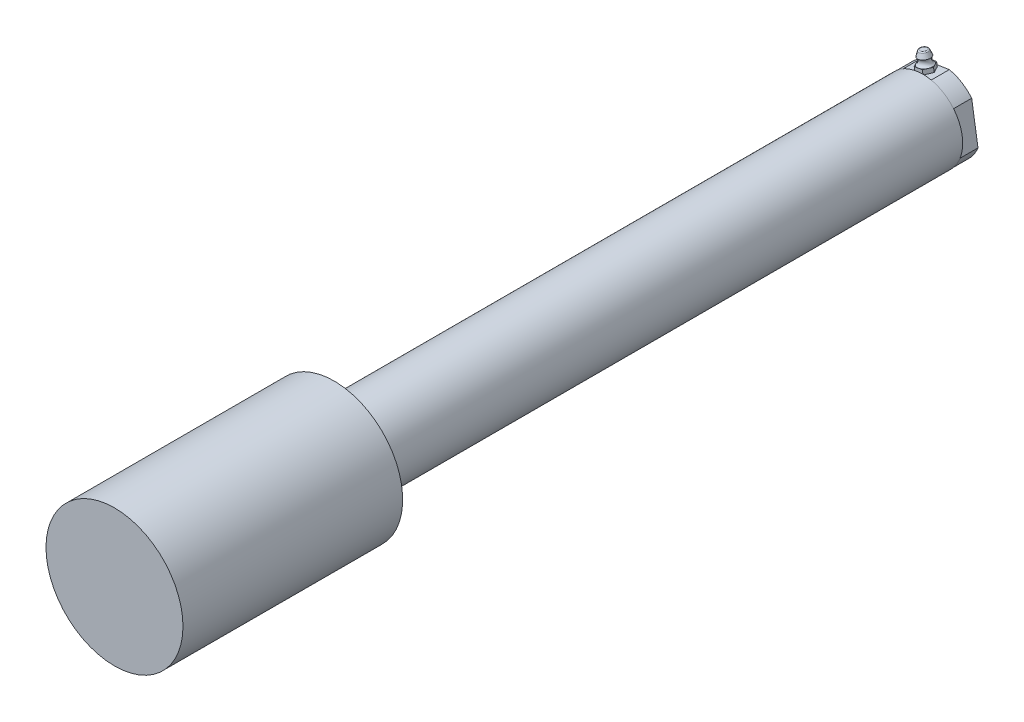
ISO-10303-21;
HEADER;
FILE_DESCRIPTION(('STEP AP214'),'2;1');
FILE_NAME('part.step','',(''),(''),'','','');
FILE_SCHEMA(('AUTOMOTIVE_DESIGN { 1 0 10303 214 1 1 1 1 }'));
ENDSEC;
DATA;
#1=APPLICATION_CONTEXT('core data for automotive mechanical design processes');
#2=APPLICATION_PROTOCOL_DEFINITION('international standard','automotive_design',2000,#1);
#3=PRODUCT_CONTEXT('',#1,'mechanical');
#4=PRODUCT('Part','Part','',(#3));
#5=PRODUCT_RELATED_PRODUCT_CATEGORY('part','',(#4));
#6=PRODUCT_DEFINITION_FORMATION('','',#4);
#7=PRODUCT_DEFINITION_CONTEXT('part definition',#1,'design');
#8=PRODUCT_DEFINITION('design','',#6,#7);
#9=PRODUCT_DEFINITION_SHAPE('','',#8);
#10=(LENGTH_UNIT() NAMED_UNIT(*) SI_UNIT(.MILLI.,.METRE.));
#11=(NAMED_UNIT(*) PLANE_ANGLE_UNIT() SI_UNIT($,.RADIAN.));
#12=(NAMED_UNIT(*) SI_UNIT($,.STERADIAN.) SOLID_ANGLE_UNIT());
#13=UNCERTAINTY_MEASURE_WITH_UNIT(LENGTH_MEASURE(1.E-05),#10,'distance_accuracy_value','');
#14=(GEOMETRIC_REPRESENTATION_CONTEXT(3) GLOBAL_UNCERTAINTY_ASSIGNED_CONTEXT((#13)) GLOBAL_UNIT_ASSIGNED_CONTEXT((#10,
#11,#12)) REPRESENTATION_CONTEXT('',''));
#15=CARTESIAN_POINT('',(0.,0.,0.));
#16=DIRECTION('',(0.,0.,1.));
#17=DIRECTION('',(1.,0.,0.));
#18=AXIS2_PLACEMENT_3D('',#15,#16,#17);
#19=CARTESIAN_POINT('',(-5.86397098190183,22.3762512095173,-458.70495));
#20=DIRECTION('',(-0.156434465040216,0.98768834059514,0.));
#21=DIRECTION('',(0.98768834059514,0.156434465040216,0.));
#22=AXIS2_PLACEMENT_3D('',#19,#20,#21);
#23=PLANE('',#22);
#24=CARTESIAN_POINT('',(-3.60082253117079,22.7346987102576,-454.7362));
#25=DIRECTION('',(0.156434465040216,-0.98768834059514,0.));
#26=DIRECTION('',(0.,0.,-1.));
#27=AXIS2_PLACEMENT_3D('',#24,#25,#26);
#28=CIRCLE('',#27,3.96875);
#29=CARTESIAN_POINT('',(-3.60082253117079,22.7346987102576,-450.76745));
#30=VERTEX_POINT('',#29);
#31=CARTESIAN_POINT('',(-6.99554520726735,22.1970274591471,-452.751825));
#32=VERTEX_POINT('',#31);
#33=EDGE_CURVE('E147',#30,#32,#28,.T.);
#34=ORIENTED_EDGE('',*,*,#33,.T.);
#35=DIRECTION('',(0.49384417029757,0.0782172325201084,0.866025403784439));
#36=VECTOR('',#35,1.);
#37=CARTESIAN_POINT('',(-8.12711943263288,22.017803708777,-454.7362));
#38=LINE('',#37,#36);
#39=CARTESIAN_POINT('',(-5.86397098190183,22.3762512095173,-450.76745));
#40=VERTEX_POINT('',#39);
#41=EDGE_CURVE('E161',#32,#40,#38,.T.);
#42=ORIENTED_EDGE('',*,*,#41,.T.);
#43=DIRECTION('',(0.98768834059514,0.156434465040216,0.));
#44=VECTOR('',#43,1.);
#45=CARTESIAN_POINT('',(-5.86397098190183,22.3762512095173,-450.76745));
#46=LINE('',#45,#44);
#47=EDGE_CURVE('E154',#40,#30,#46,.T.);
#48=ORIENTED_EDGE('',*,*,#47,.T.);
#49=EDGE_LOOP('',(#34,#42,#48));
#50=FACE_BOUND('',#49,.T.);
#51=ADVANCED_FACE('F17',(#50),#23,.T.);
#52=CARTESIAN_POINT('',(-0.206099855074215,23.2723699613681,-452.751825));
#53=VERTEX_POINT('',#52);
#54=EDGE_CURVE('E136',#53,#30,#28,.T.);
#55=ORIENTED_EDGE('',*,*,#54,.T.);
#56=CARTESIAN_POINT('',(-1.33767408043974,23.093146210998,-450.76745));
#57=VERTEX_POINT('',#56);
#58=EDGE_CURVE('E139',#30,#57,#46,.T.);
#59=ORIENTED_EDGE('',*,*,#58,.T.);
#60=DIRECTION('',(0.49384417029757,0.0782172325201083,-0.866025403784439));
#61=VECTOR('',#60,1.);
#62=CARTESIAN_POINT('',(-1.33767408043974,23.093146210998,-450.76745));
#63=LINE('',#62,#61);
#64=EDGE_CURVE('E142',#57,#53,#63,.T.);
#65=ORIENTED_EDGE('',*,*,#64,.T.);
#66=EDGE_LOOP('',(#55,#59,#65));
#67=FACE_BOUND('',#66,.T.);
#68=ADVANCED_FACE('F138',(#67),#23,.T.);
#69=CARTESIAN_POINT('',(-0.206099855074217,23.2723699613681,-456.720575));
#70=VERTEX_POINT('',#69);
#71=EDGE_CURVE('E146',#70,#53,#28,.T.);
#72=ORIENTED_EDGE('',*,*,#71,.T.);
#73=CARTESIAN_POINT('',(0.925474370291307,23.4515937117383,-454.7362));
#74=VERTEX_POINT('',#73);
#75=EDGE_CURVE('E163',#53,#74,#63,.T.);
#76=ORIENTED_EDGE('',*,*,#75,.T.);
#77=DIRECTION('',(-0.49384417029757,-0.0782172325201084,-0.866025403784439));
#78=VECTOR('',#77,1.);
#79=CARTESIAN_POINT('',(0.925474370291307,23.4515937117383,-454.7362));
#80=LINE('',#79,#78);
#81=EDGE_CURVE('E182',#74,#70,#80,.T.);
#82=ORIENTED_EDGE('',*,*,#81,.T.);
#83=EDGE_LOOP('',(#72,#76,#82));
#84=FACE_BOUND('',#83,.T.);
#85=ADVANCED_FACE('F306',(#84),#23,.T.);
#86=CARTESIAN_POINT('',(-3.60082253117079,22.7346987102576,-458.70495));
#87=VERTEX_POINT('',#86);
#88=EDGE_CURVE('E37',#87,#70,#28,.T.);
#89=ORIENTED_EDGE('',*,*,#88,.T.);
#90=CARTESIAN_POINT('',(-1.33767408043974,23.093146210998,-458.70495));
#91=VERTEX_POINT('',#90);
#92=EDGE_CURVE('E181',#70,#91,#80,.T.);
#93=ORIENTED_EDGE('',*,*,#92,.T.);
#94=DIRECTION('',(-0.98768834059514,-0.156434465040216,0.));
#95=VECTOR('',#94,1.);
#96=CARTESIAN_POINT('',(-1.33767408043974,23.093146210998,-458.70495));
#97=LINE('',#96,#95);
#98=EDGE_CURVE('E172',#91,#87,#97,.T.);
#99=ORIENTED_EDGE('',*,*,#98,.T.);
#100=EDGE_LOOP('',(#89,#93,#99));
#101=FACE_BOUND('',#100,.T.);
#102=ADVANCED_FACE('F324',(#101),#23,.T.);
#103=CARTESIAN_POINT('',(-6.99554520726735,22.1970274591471,-456.720575));
#104=VERTEX_POINT('',#103);
#105=EDGE_CURVE('E167',#104,#87,#28,.T.);
#106=ORIENTED_EDGE('',*,*,#105,.T.);
#107=CARTESIAN_POINT('',(-5.86397098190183,22.3762512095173,-458.70495));
#108=VERTEX_POINT('',#107);
#109=EDGE_CURVE('E175',#87,#108,#97,.T.);
#110=ORIENTED_EDGE('',*,*,#109,.T.);
#111=DIRECTION('',(-0.493844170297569,-0.0782172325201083,0.866025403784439));
#112=VECTOR('',#111,1.);
#113=CARTESIAN_POINT('',(-5.86397098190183,22.3762512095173,-458.70495));
#114=LINE('',#113,#112);
#115=EDGE_CURVE('E176',#108,#104,#114,.T.);
#116=ORIENTED_EDGE('',*,*,#115,.T.);
#117=EDGE_LOOP('',(#106,#110,#116));
#118=FACE_BOUND('',#117,.T.);
#119=ADVANCED_FACE('F312',(#118),#23,.T.);
#120=CARTESIAN_POINT('',(-1.33767408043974,23.093146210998,-458.70495));
#121=DIRECTION('',(0.,0.,1.));
#122=DIRECTION('',(0.156434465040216,-0.98768834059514,0.));
#123=AXIS2_PLACEMENT_3D('',#120,#121,#122);
#124=PLANE('',#123);
#125=DIRECTION('',(-0.98768834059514,-0.156434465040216,0.));
#126=VECTOR('',#125,1.);
#127=CARTESIAN_POINT('',(-0.965164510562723,20.7412133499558,-458.70495));
#128=LINE('',#127,#126);
#129=CARTESIAN_POINT('',(-0.965164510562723,20.7412133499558,-458.70495));
#130=VERTEX_POINT('',#129);
#131=CARTESIAN_POINT('',(-5.49146141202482,20.0243183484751,-458.70495));
#132=VERTEX_POINT('',#131);
#133=EDGE_CURVE('E170',#130,#132,#128,.T.);
#134=ORIENTED_EDGE('',*,*,#133,.T.);
#135=DIRECTION('',(0.156434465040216,-0.98768834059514,0.));
#136=VECTOR('',#135,1.);
#137=CARTESIAN_POINT('',(-5.86397098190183,22.3762512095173,-458.70495));
#138=LINE('',#137,#136);
#139=EDGE_CURVE('E209',#108,#132,#138,.T.);
#140=ORIENTED_EDGE('',*,*,#139,.F.);
#141=ORIENTED_EDGE('',*,*,#109,.F.);
#142=ORIENTED_EDGE('',*,*,#98,.F.);
#143=DIRECTION('',(0.156434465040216,-0.98768834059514,0.));
#144=VECTOR('',#143,1.);
#145=CARTESIAN_POINT('',(-1.33767408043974,23.093146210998,-458.70495));
#146=LINE('',#145,#144);
#147=EDGE_CURVE('E185',#91,#130,#146,.T.);
#148=ORIENTED_EDGE('',*,*,#147,.T.);
#149=EDGE_LOOP('',(#134,#140,#141,#142,#148));
#150=FACE_BOUND('',#149,.T.);
#151=ADVANCED_FACE('F323',(#150),#124,.F.);
#152=CARTESIAN_POINT('',(-5.86397098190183,22.3762512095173,-458.70495));
#153=DIRECTION('',(0.855363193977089,0.135476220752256,0.5));
#154=DIRECTION('',(0.49384417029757,0.0782172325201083,-0.866025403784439));
#155=AXIS2_PLACEMENT_3D('',#152,#153,#154);
#156=PLANE('',#155);
#157=DIRECTION('',(-0.493844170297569,-0.0782172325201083,0.866025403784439));
#158=VECTOR('',#157,1.);
#159=CARTESIAN_POINT('',(-5.49146141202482,20.0243183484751,-458.70495));
#160=LINE('',#159,#158);
#161=CARTESIAN_POINT('',(-7.75460986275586,19.6658708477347,-454.7362));
#162=VERTEX_POINT('',#161);
#163=EDGE_CURVE('E188',#132,#162,#160,.T.);
#164=ORIENTED_EDGE('',*,*,#163,.T.);
#165=DIRECTION('',(0.156434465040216,-0.98768834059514,0.));
#166=VECTOR('',#165,1.);
#167=CARTESIAN_POINT('',(-8.12711943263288,22.017803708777,-454.7362));
#168=LINE('',#167,#166);
#169=CARTESIAN_POINT('',(-8.12711943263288,22.017803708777,-454.7362));
#170=VERTEX_POINT('',#169);
#171=EDGE_CURVE('E206',#170,#162,#168,.T.);
#172=ORIENTED_EDGE('',*,*,#171,.F.);
#173=EDGE_CURVE('E174',#104,#170,#114,.T.);
#174=ORIENTED_EDGE('',*,*,#173,.F.);
#175=ORIENTED_EDGE('',*,*,#115,.F.);
#176=ORIENTED_EDGE('',*,*,#139,.T.);
#177=EDGE_LOOP('',(#164,#172,#174,#175,#176));
#178=FACE_BOUND('',#177,.T.);
#179=ADVANCED_FACE('F331',(#178),#156,.F.);
#180=CARTESIAN_POINT('',(-8.12711943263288,22.017803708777,-454.7362));
#181=DIRECTION('',(0.855363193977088,0.135476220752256,-0.5));
#182=DIRECTION('',(-0.49384417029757,-0.0782172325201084,-0.866025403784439));
#183=AXIS2_PLACEMENT_3D('',#180,#181,#182);
#184=PLANE('',#183);
#185=DIRECTION('',(0.49384417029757,0.0782172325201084,0.866025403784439));
#186=VECTOR('',#185,1.);
#187=CARTESIAN_POINT('',(-7.75460986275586,19.6658708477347,-454.7362));
#188=LINE('',#187,#186);
#189=CARTESIAN_POINT('',(-5.49146141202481,20.0243183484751,-450.76745));
#190=VERTEX_POINT('',#189);
#191=EDGE_CURVE('E190',#162,#190,#188,.T.);
#192=ORIENTED_EDGE('',*,*,#191,.T.);
#193=DIRECTION('',(0.156434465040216,-0.98768834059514,0.));
#194=VECTOR('',#193,1.);
#195=CARTESIAN_POINT('',(-5.86397098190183,22.3762512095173,-450.76745));
#196=LINE('',#195,#194);
#197=EDGE_CURVE('E204',#40,#190,#196,.T.);
#198=ORIENTED_EDGE('',*,*,#197,.F.);
#199=ORIENTED_EDGE('',*,*,#41,.F.);
#200=EDGE_CURVE('E92',#170,#32,#38,.T.);
#201=ORIENTED_EDGE('',*,*,#200,.F.);
#202=ORIENTED_EDGE('',*,*,#171,.T.);
#203=EDGE_LOOP('',(#192,#198,#199,#201,#202));
#204=FACE_BOUND('',#203,.T.);
#205=ADVANCED_FACE('F353',(#204),#184,.F.);
#206=CARTESIAN_POINT('',(-5.86397098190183,22.3762512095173,-450.76745));
#207=DIRECTION('',(0.,0.,-1.));
#208=DIRECTION('',(-0.98768834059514,-0.156434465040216,0.));
#209=AXIS2_PLACEMENT_3D('',#206,#207,#208);
#210=PLANE('',#209);
#211=DIRECTION('',(0.98768834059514,0.156434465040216,0.));
#212=VECTOR('',#211,1.);
#213=CARTESIAN_POINT('',(-5.49146141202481,20.0243183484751,-450.76745));
#214=LINE('',#213,#212);
#215=CARTESIAN_POINT('',(-0.965164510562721,20.7412133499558,-450.76745));
#216=VERTEX_POINT('',#215);
#217=EDGE_CURVE('E192',#190,#216,#214,.T.);
#218=ORIENTED_EDGE('',*,*,#217,.T.);
#219=DIRECTION('',(0.156434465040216,-0.98768834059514,0.));
#220=VECTOR('',#219,1.);
#221=CARTESIAN_POINT('',(-1.33767408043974,23.093146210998,-450.76745));
#222=LINE('',#221,#220);
#223=EDGE_CURVE('E156',#57,#216,#222,.T.);
#224=ORIENTED_EDGE('',*,*,#223,.F.);
#225=ORIENTED_EDGE('',*,*,#58,.F.);
#226=ORIENTED_EDGE('',*,*,#47,.F.);
#227=ORIENTED_EDGE('',*,*,#197,.T.);
#228=EDGE_LOOP('',(#218,#224,#225,#226,#227));
#229=FACE_BOUND('',#228,.T.);
#230=ADVANCED_FACE('F152',(#229),#210,.F.);
#231=CARTESIAN_POINT('',(-1.33767408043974,23.093146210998,-450.76745));
#232=DIRECTION('',(-0.855363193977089,-0.135476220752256,-0.5));
#233=DIRECTION('',(-0.49384417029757,-0.0782172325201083,0.866025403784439));
#234=AXIS2_PLACEMENT_3D('',#231,#232,#233);
#235=PLANE('',#234);
#236=DIRECTION('',(0.49384417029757,0.0782172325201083,-0.866025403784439));
#237=VECTOR('',#236,1.);
#238=CARTESIAN_POINT('',(-0.965164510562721,20.7412133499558,-450.76745));
#239=LINE('',#238,#237);
#240=CARTESIAN_POINT('',(1.29798394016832,21.0996608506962,-454.7362));
#241=VERTEX_POINT('',#240);
#242=EDGE_CURVE('E194',#216,#241,#239,.T.);
#243=ORIENTED_EDGE('',*,*,#242,.T.);
#244=DIRECTION('',(0.156434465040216,-0.98768834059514,0.));
#245=VECTOR('',#244,1.);
#246=CARTESIAN_POINT('',(0.925474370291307,23.4515937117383,-454.7362));
#247=LINE('',#246,#245);
#248=EDGE_CURVE('E200',#74,#241,#247,.T.);
#249=ORIENTED_EDGE('',*,*,#248,.F.);
#250=ORIENTED_EDGE('',*,*,#75,.F.);
#251=ORIENTED_EDGE('',*,*,#64,.F.);
#252=ORIENTED_EDGE('',*,*,#223,.T.);
#253=EDGE_LOOP('',(#243,#249,#250,#251,#252));
#254=FACE_BOUND('',#253,.T.);
#255=ADVANCED_FACE('F320',(#254),#235,.F.);
#256=CARTESIAN_POINT('',(0.925474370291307,23.4515937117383,-454.7362));
#257=DIRECTION('',(-0.855363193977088,-0.135476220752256,0.5));
#258=DIRECTION('',(0.49384417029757,0.0782172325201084,0.866025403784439));
#259=AXIS2_PLACEMENT_3D('',#256,#257,#258);
#260=PLANE('',#259);
#261=DIRECTION('',(-0.49384417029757,-0.0782172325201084,-0.866025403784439));
#262=VECTOR('',#261,1.);
#263=CARTESIAN_POINT('',(1.29798394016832,21.0996608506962,-454.7362));
#264=LINE('',#263,#262);
#265=EDGE_CURVE('E196',#241,#130,#264,.T.);
#266=ORIENTED_EDGE('',*,*,#265,.T.);
#267=ORIENTED_EDGE('',*,*,#147,.F.);
#268=ORIENTED_EDGE('',*,*,#92,.F.);
#269=ORIENTED_EDGE('',*,*,#81,.F.);
#270=ORIENTED_EDGE('',*,*,#248,.T.);
#271=EDGE_LOOP('',(#266,#267,#268,#269,#270));
#272=FACE_BOUND('',#271,.T.);
#273=ADVANCED_FACE('F311',(#272),#260,.F.);
#274=EDGE_CURVE('E166',#32,#104,#28,.T.);
#275=ORIENTED_EDGE('',*,*,#274,.T.);
#276=ORIENTED_EDGE('',*,*,#173,.T.);
#277=ORIENTED_EDGE('',*,*,#200,.T.);
#278=EDGE_LOOP('',(#275,#276,#277));
#279=FACE_BOUND('',#278,.T.);
#280=ADVANCED_FACE('F301',(#279),#23,.T.);
#281=CARTESIAN_POINT('',(-4.17945406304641,26.3880344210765,-454.7362));
#282=DIRECTION('',(0.156434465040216,-0.98768834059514,0.));
#283=DIRECTION('',(0.,0.,-1.));
#284=AXIS2_PLACEMENT_3D('',#281,#282,#283);
#285=CONICAL_SURFACE('',#284,3.3655,0.340381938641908);
#286=CARTESIAN_POINT('',(-4.57685885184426,28.8971495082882,-454.7362));
#287=DIRECTION('',(-0.156434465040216,0.98768834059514,0.));
#288=DIRECTION('',(0.,0.,1.));
#289=AXIS2_PLACEMENT_3D('',#286,#287,#288);
#290=CIRCLE('',#289,2.46577800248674);
#291=CARTESIAN_POINT('',(-4.57685885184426,28.8971495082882,-452.270421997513));
#292=VERTEX_POINT('',#291);
#293=EDGE_CURVE('E212',#292,#292,#290,.F.);
#294=ORIENTED_EDGE('',*,*,#293,.T.);
#295=EDGE_LOOP('',(#294));
#296=FACE_BOUND('',#295,.T.);
#297=CARTESIAN_POINT('',(-4.17945406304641,26.3880344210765,-454.7362));
#298=DIRECTION('',(0.156434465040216,-0.98768834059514,0.));
#299=DIRECTION('',(0.,0.,-1.));
#300=AXIS2_PLACEMENT_3D('',#297,#298,#299);
#301=CIRCLE('',#300,3.3655);
#302=CARTESIAN_POINT('',(-4.17945406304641,26.3880344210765,-458.1017));
#303=VERTEX_POINT('',#302);
#304=EDGE_CURVE('E171',#303,#303,#301,.T.);
#305=ORIENTED_EDGE('',*,*,#304,.F.);
#306=EDGE_LOOP('',(#305));
#307=FACE_BOUND('',#306,.T.);
#308=ADVANCED_FACE('F310',(#296,#307),#285,.T.);
#309=CARTESIAN_POINT('',(-4.656266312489,29.3985084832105,-454.7362));
#310=DIRECTION('',(-0.156434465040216,0.98768834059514,0.));
#311=DIRECTION('',(0.,0.,1.));
#312=AXIS2_PLACEMENT_3D('',#309,#310,#311);
#313=PLANE('',#312);
#314=CARTESIAN_POINT('',(-4.656266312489,29.3985084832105,-454.7362));
#315=DIRECTION('',(-0.156434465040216,0.98768834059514,0.));
#316=DIRECTION('',(0.,0.,1.));
#317=AXIS2_PLACEMENT_3D('',#314,#315,#316);
#318=CIRCLE('',#317,1.7474960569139);
#319=CARTESIAN_POINT('',(-4.656266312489,29.3985084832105,-452.988703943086));
#320=VERTEX_POINT('',#319);
#321=EDGE_CURVE('E28',#320,#320,#318,.T.);
#322=ORIENTED_EDGE('',*,*,#321,.T.);
#323=EDGE_LOOP('',(#322));
#324=FACE_BOUND('',#323,.T.);
#325=ADVANCED_FACE('F318',(#324),#313,.T.);
#326=CARTESIAN_POINT('',(-3.92942332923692,24.8094024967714,-454.7362));
#327=DIRECTION('',(0.156434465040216,-0.98768834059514,0.));
#328=DIRECTION('',(0.,0.,-1.));
#329=AXIS2_PLACEMENT_3D('',#326,#327,#328);
#330=TOROIDAL_SURFACE('',#329,5.20693450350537,2.43833450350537);
#331=ORIENTED_EDGE('',*,*,#304,.T.);
#332=EDGE_LOOP('',(#331));
#333=FACE_BOUND('',#332,.T.);
#334=ORIENTED_EDGE('',*,*,#88,.F.);
#335=ORIENTED_EDGE('',*,*,#105,.F.);
#336=ORIENTED_EDGE('',*,*,#274,.F.);
#337=ORIENTED_EDGE('',*,*,#33,.F.);
#338=ORIENTED_EDGE('',*,*,#54,.F.);
#339=ORIENTED_EDGE('',*,*,#71,.F.);
#340=EDGE_LOOP('',(#334,#335,#336,#337,#338,#339));
#341=FACE_BOUND('',#340,.T.);
#342=ADVANCED_FACE('F164',(#333,#341),#330,.F.);
#343=CARTESIAN_POINT('',(-4.53706325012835,28.645889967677,-454.7362));
#344=DIRECTION('',(-0.156434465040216,0.98768834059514,0.));
#345=DIRECTION('',(0.,0.,1.));
#346=AXIS2_PLACEMENT_3D('',#343,#344,#345);
#347=TOROIDAL_SURFACE('',#346,1.7474960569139,0.762);
#348=ORIENTED_EDGE('',*,*,#321,.F.);
#349=EDGE_LOOP('',(#348));
#350=FACE_BOUND('',#349,.T.);
#351=ORIENTED_EDGE('',*,*,#293,.F.);
#352=EDGE_LOOP('',(#351));
#353=FACE_BOUND('',#352,.T.);
#354=ADVANCED_FACE('F411',(#350,#353),#347,.T.);
#355=CARTESIAN_POINT('',(0.,0.,0.));
#356=DIRECTION('',(0.,0.,1.));
#357=DIRECTION('',(1.,0.,0.));
#358=AXIS2_PLACEMENT_3D('',#355,#356,#357);
#359=PLANE('',#358);
#360=CARTESIAN_POINT('',(0.,0.,0.));
#361=DIRECTION('',(0.,0.,1.));
#362=DIRECTION('',(1.,0.,0.));
#363=AXIS2_PLACEMENT_3D('',#360,#361,#362);
#364=CIRCLE('',#363,38.1);
#365=CARTESIAN_POINT('',(38.1,0.,0.));
#366=VERTEX_POINT('',#365);
#367=EDGE_CURVE('E265',#366,#366,#364,.T.);
#368=ORIENTED_EDGE('',*,*,#367,.T.);
#369=EDGE_LOOP('',(#368));
#370=FACE_BOUND('',#369,.T.);
#371=ADVANCED_FACE('F294',(#370),#359,.T.);
#372=CARTESIAN_POINT('',(0.,0.,0.));
#373=DIRECTION('',(0.,0.,-1.));
#374=DIRECTION('',(-1.,0.,0.));
#375=AXIS2_PLACEMENT_3D('',#372,#373,#374);
#376=CYLINDRICAL_SURFACE('',#375,38.1);
#377=ORIENTED_EDGE('',*,*,#367,.F.);
#378=EDGE_LOOP('',(#377));
#379=FACE_BOUND('',#378,.T.);
#380=CARTESIAN_POINT('',(0.,0.,-122.21972));
#381=DIRECTION('',(0.,0.,-1.));
#382=DIRECTION('',(-1.,0.,0.));
#383=AXIS2_PLACEMENT_3D('',#380,#381,#382);
#384=CIRCLE('',#383,38.1);
#385=CARTESIAN_POINT('',(-38.1,0.,-122.21972));
#386=VERTEX_POINT('',#385);
#387=EDGE_CURVE('E262',#386,#386,#384,.T.);
#388=ORIENTED_EDGE('',*,*,#387,.F.);
#389=EDGE_LOOP('',(#388));
#390=FACE_BOUND('',#389,.T.);
#391=ADVANCED_FACE('F409',(#379,#390),#376,.T.);
#392=CARTESIAN_POINT('',(0.,0.,-421.7162));
#393=DIRECTION('',(0.,0.,-1.));
#394=DIRECTION('',(-0.156434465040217,0.98768834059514,0.));
#395=AXIS2_PLACEMENT_3D('',#392,#393,#394);
#396=PLANE('',#395);
#397=CARTESIAN_POINT('',(0.,0.,-421.7162));
#398=DIRECTION('',(0.,0.,-1.));
#399=DIRECTION('',(-0.156434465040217,0.98768834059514,0.));
#400=AXIS2_PLACEMENT_3D('',#397,#398,#399);
#401=CIRCLE('',#400,8.73125);
#402=CARTESIAN_POINT('',(-1.3658684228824,8.62375382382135,-421.7162));
#403=VERTEX_POINT('',#402);
#404=EDGE_CURVE('E217',#403,#403,#401,.T.);
#405=ORIENTED_EDGE('',*,*,#404,.T.);
#406=EDGE_LOOP('',(#405));
#407=FACE_BOUND('',#406,.T.);
#408=ADVANCED_FACE('F289',(#407),#396,.T.);
#409=CARTESIAN_POINT('',(0.,0.,-122.21972));
#410=DIRECTION('',(0.,0.,-1.));
#411=DIRECTION('',(-1.,0.,0.));
#412=AXIS2_PLACEMENT_3D('',#409,#410,#411);
#413=PLANE('',#412);
#414=CARTESIAN_POINT('',(0.,0.,-122.21972));
#415=DIRECTION('',(0.,0.,-1.));
#416=DIRECTION('',(-1.,0.,0.));
#417=AXIS2_PLACEMENT_3D('',#414,#415,#416);
#418=CIRCLE('',#417,22.225);
#419=CARTESIAN_POINT('',(-22.225,0.,-122.21972));
#420=VERTEX_POINT('',#419);
#421=EDGE_CURVE('E21',#420,#420,#418,.T.);
#422=ORIENTED_EDGE('',*,*,#421,.F.);
#423=EDGE_LOOP('',(#422));
#424=FACE_BOUND('',#423,.T.);
#425=ORIENTED_EDGE('',*,*,#387,.T.);
#426=EDGE_LOOP('',(#425));
#427=FACE_BOUND('',#426,.T.);
#428=ADVANCED_FACE('F276',(#424,#427),#413,.T.);
#429=CARTESIAN_POINT('',(0.,0.,-459.8162));
#430=DIRECTION('',(0.,0.,-1.));
#431=DIRECTION('',(-0.156434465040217,0.98768834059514,0.));
#432=AXIS2_PLACEMENT_3D('',#429,#430,#431);
#433=CYLINDRICAL_SURFACE('',#432,8.73125);
#434=ORIENTED_EDGE('',*,*,#404,.F.);
#435=EDGE_LOOP('',(#434));
#436=FACE_BOUND('',#435,.T.);
#437=CARTESIAN_POINT('',(0.,0.,-459.8162));
#438=DIRECTION('',(0.,0.,-1.));
#439=DIRECTION('',(-0.156434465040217,0.98768834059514,0.));
#440=AXIS2_PLACEMENT_3D('',#437,#438,#439);
#441=CIRCLE('',#440,8.73125);
#442=CARTESIAN_POINT('',(-1.3658684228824,8.62375382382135,-459.8162));
#443=VERTEX_POINT('',#442);
#444=EDGE_CURVE('E250',#443,#443,#441,.T.);
#445=ORIENTED_EDGE('',*,*,#444,.T.);
#446=EDGE_LOOP('',(#445));
#447=FACE_BOUND('',#446,.T.);
#448=ADVANCED_FACE('F274',(#436,#447),#433,.F.);
#449=CARTESIAN_POINT('',(0.,0.,-449.6562));
#450=DIRECTION('',(0.,0.,1.));
#451=DIRECTION('',(1.,0.,0.));
#452=AXIS2_PLACEMENT_3D('',#449,#450,#451);
#453=CYLINDRICAL_SURFACE('',#452,22.225);
#454=ORIENTED_EDGE('',*,*,#421,.T.);
#455=EDGE_LOOP('',(#454));
#456=FACE_BOUND('',#455,.T.);
#457=CARTESIAN_POINT('',(0.,0.,-449.6562));
#458=DIRECTION('',(0.,0.,-1.));
#459=DIRECTION('',(-1.,0.,0.));
#460=AXIS2_PLACEMENT_3D('',#457,#458,#459);
#461=CIRCLE('',#460,22.225);
#462=CARTESIAN_POINT('',(-22.225,0.,-449.6562));
#463=VERTEX_POINT('',#462);
#464=EDGE_CURVE('E221',#463,#463,#461,.T.);
#465=ORIENTED_EDGE('',*,*,#464,.F.);
#466=EDGE_LOOP('',(#465));
#467=FACE_BOUND('',#466,.T.);
#468=ADVANCED_FACE('F19',(#456,#467),#453,.T.);
#469=CARTESIAN_POINT('',(20.571299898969,-8.10584202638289,-427.000293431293));
#470=DIRECTION('',(-0.98768834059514,-0.156434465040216,0.));
#471=DIRECTION('',(-0.156434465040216,0.98768834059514,0.));
#472=AXIS2_PLACEMENT_3D('',#469,#470,#471);
#473=PLANE('',#472);
#474=DIRECTION('',(0.156434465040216,-0.98768834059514,0.));
#475=VECTOR('',#474,1.);
#476=CARTESIAN_POINT('',(20.571299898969,-8.10584202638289,-449.6562));
#477=LINE('',#476,#475);
#478=CARTESIAN_POINT('',(17.0596258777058,14.0659951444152,-449.6562));
#479=VERTEX_POINT('',#478);
#480=CARTESIAN_POINT('',(20.571299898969,-8.10584202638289,-449.6562));
#481=VERTEX_POINT('',#480);
#482=EDGE_CURVE('E247',#479,#481,#477,.T.);
#483=ORIENTED_EDGE('',*,*,#482,.T.);
#484=DIRECTION('',(0.,0.,-1.));
#485=VECTOR('',#484,1.);
#486=CARTESIAN_POINT('',(20.571299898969,-8.10584202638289,-427.000293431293));
#487=LINE('',#486,#485);
#488=CARTESIAN_POINT('',(20.571299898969,-8.10584202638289,-459.8162));
#489=VERTEX_POINT('',#488);
#490=EDGE_CURVE('E243',#481,#489,#487,.T.);
#491=ORIENTED_EDGE('',*,*,#490,.T.);
#492=DIRECTION('',(-0.156434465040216,0.98768834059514,0.));
#493=VECTOR('',#492,1.);
#494=CARTESIAN_POINT('',(20.571299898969,-8.10584202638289,-459.8162));
#495=LINE('',#494,#493);
#496=CARTESIAN_POINT('',(17.0596258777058,14.0659951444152,-459.8162));
#497=VERTEX_POINT('',#496);
#498=EDGE_CURVE('E240',#489,#497,#495,.T.);
#499=ORIENTED_EDGE('',*,*,#498,.T.);
#500=DIRECTION('',(0.,0.,-1.));
#501=VECTOR('',#500,1.);
#502=CARTESIAN_POINT('',(17.0596258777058,14.0659951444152,-427.000293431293));
#503=LINE('',#502,#501);
#504=EDGE_CURVE('E244',#479,#497,#503,.T.);
#505=ORIENTED_EDGE('',*,*,#504,.F.);
#506=EDGE_LOOP('',(#483,#491,#499,#505));
#507=FACE_BOUND('',#506,.T.);
#508=ADVANCED_FACE('F273',(#507),#473,.F.);
#509=CARTESIAN_POINT('',(0.,0.,-449.6562));
#510=DIRECTION('',(0.,0.,-1.));
#511=DIRECTION('',(-0.156434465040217,0.98768834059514,0.));
#512=AXIS2_PLACEMENT_3D('',#509,#510,#511);
#513=CYLINDRICAL_SURFACE('',#512,22.1107);
#514=DIRECTION('',(0.,0.,-1.));
#515=VECTOR('',#514,1.);
#516=CARTESIAN_POINT('',(-17.0596258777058,-14.0659951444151,-427.000293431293));
#517=LINE('',#516,#515);
#518=CARTESIAN_POINT('',(-17.0596258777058,-14.0659951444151,-449.6562));
#519=VERTEX_POINT('',#518);
#520=CARTESIAN_POINT('',(-17.0596258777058,-14.0659951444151,-459.8162));
#521=VERTEX_POINT('',#520);
#522=EDGE_CURVE('E234',#519,#521,#517,.T.);
#523=ORIENTED_EDGE('',*,*,#522,.T.);
#524=CARTESIAN_POINT('',(0.,0.,-459.8162));
#525=DIRECTION('',(0.,0.,-1.));
#526=DIRECTION('',(-0.156434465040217,0.98768834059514,0.));
#527=AXIS2_PLACEMENT_3D('',#524,#525,#526);
#528=CIRCLE('',#527,22.1107);
#529=EDGE_CURVE('E258',#489,#521,#528,.T.);
#530=ORIENTED_EDGE('',*,*,#529,.F.);
#531=ORIENTED_EDGE('',*,*,#490,.F.);
#532=CARTESIAN_POINT('',(0.,0.,-449.6562));
#533=DIRECTION('',(0.,0.,-1.));
#534=DIRECTION('',(-0.156434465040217,0.98768834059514,0.));
#535=AXIS2_PLACEMENT_3D('',#532,#533,#534);
#536=CIRCLE('',#535,22.1107);
#537=EDGE_CURVE('E254',#481,#519,#536,.T.);
#538=ORIENTED_EDGE('',*,*,#537,.T.);
#539=EDGE_LOOP('',(#523,#530,#531,#538));
#540=FACE_BOUND('',#539,.T.);
#541=ADVANCED_FACE('F283',(#540),#513,.T.);
#542=CARTESIAN_POINT('',(-17.0596258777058,-14.0659951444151,-427.000293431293));
#543=DIRECTION('',(0.98768834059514,0.156434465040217,0.));
#544=DIRECTION('',(0.,0.,-1.));
#545=AXIS2_PLACEMENT_3D('',#542,#543,#544);
#546=PLANE('',#545);
#547=DIRECTION('',(-0.156434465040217,0.98768834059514,0.));
#548=VECTOR('',#547,1.);
#549=CARTESIAN_POINT('',(-17.0596258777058,-14.0659951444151,-449.6562));
#550=LINE('',#549,#548);
#551=CARTESIAN_POINT('',(-20.5712998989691,8.10584202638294,-449.6562));
#552=VERTEX_POINT('',#551);
#553=EDGE_CURVE('E237',#519,#552,#550,.T.);
#554=ORIENTED_EDGE('',*,*,#553,.T.);
#555=DIRECTION('',(0.,0.,-1.));
#556=VECTOR('',#555,1.);
#557=CARTESIAN_POINT('',(-20.5712998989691,8.10584202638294,-427.000293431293));
#558=LINE('',#557,#556);
#559=CARTESIAN_POINT('',(-20.5712998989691,8.10584202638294,-459.8162));
#560=VERTEX_POINT('',#559);
#561=EDGE_CURVE('E77',#552,#560,#558,.T.);
#562=ORIENTED_EDGE('',*,*,#561,.T.);
#563=DIRECTION('',(0.156434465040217,-0.98768834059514,0.));
#564=VECTOR('',#563,1.);
#565=CARTESIAN_POINT('',(-17.0596258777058,-14.0659951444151,-459.8162));
#566=LINE('',#565,#564);
#567=EDGE_CURVE('E232',#560,#521,#566,.T.);
#568=ORIENTED_EDGE('',*,*,#567,.T.);
#569=ORIENTED_EDGE('',*,*,#522,.F.);
#570=EDGE_LOOP('',(#554,#562,#568,#569));
#571=FACE_BOUND('',#570,.T.);
#572=ADVANCED_FACE('F286',(#571),#546,.F.);
#573=DIRECTION('',(0.,0.,-1.));
#574=VECTOR('',#573,1.);
#575=CARTESIAN_POINT('',(-11.0680891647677,19.1410672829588,-433.712929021));
#576=LINE('',#575,#574);
#577=CARTESIAN_POINT('',(-11.0680891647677,19.1410672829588,-449.6562));
#578=VERTEX_POINT('',#577);
#579=CARTESIAN_POINT('',(-11.0680891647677,19.1410672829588,-459.8162));
#580=VERTEX_POINT('',#579);
#581=EDGE_CURVE('E226',#578,#580,#576,.T.);
#582=ORIENTED_EDGE('',*,*,#581,.T.);
#583=EDGE_CURVE('E261',#560,#580,#528,.T.);
#584=ORIENTED_EDGE('',*,*,#583,.F.);
#585=ORIENTED_EDGE('',*,*,#561,.F.);
#586=EDGE_CURVE('E256',#552,#578,#536,.T.);
#587=ORIENTED_EDGE('',*,*,#586,.T.);
#588=EDGE_LOOP('',(#582,#584,#585,#587));
#589=FACE_BOUND('',#588,.T.);
#590=ADVANCED_FACE('F374',(#589),#513,.T.);
#591=CARTESIAN_POINT('',(0.,0.,-459.8162));
#592=DIRECTION('',(0.,0.,-1.));
#593=DIRECTION('',(-0.156434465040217,0.98768834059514,0.));
#594=AXIS2_PLACEMENT_3D('',#591,#592,#593);
#595=PLANE('',#594);
#596=DIRECTION('',(-0.98768834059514,-0.156434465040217,0.));
#597=VECTOR('',#596,1.);
#598=CARTESIAN_POINT('',(4.61146324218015,21.6244644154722,-459.8162));
#599=LINE('',#598,#597);
#600=CARTESIAN_POINT('',(4.61146324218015,21.6244644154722,-459.8162));
#601=VERTEX_POINT('',#600);
#602=EDGE_CURVE('E224',#601,#580,#599,.T.);
#603=ORIENTED_EDGE('',*,*,#602,.F.);
#604=EDGE_CURVE('E253',#601,#497,#528,.T.);
#605=ORIENTED_EDGE('',*,*,#604,.T.);
#606=ORIENTED_EDGE('',*,*,#498,.F.);
#607=ORIENTED_EDGE('',*,*,#529,.T.);
#608=ORIENTED_EDGE('',*,*,#567,.F.);
#609=ORIENTED_EDGE('',*,*,#583,.T.);
#610=EDGE_LOOP('',(#603,#605,#606,#607,#608,#609));
#611=FACE_BOUND('',#610,.T.);
#612=ORIENTED_EDGE('',*,*,#444,.F.);
#613=EDGE_LOOP('',(#612));
#614=FACE_BOUND('',#613,.T.);
#615=ADVANCED_FACE('F371',(#611,#614),#595,.T.);
#616=DIRECTION('',(0.,0.,-1.));
#617=VECTOR('',#616,1.);
#618=CARTESIAN_POINT('',(4.61146324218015,21.6244644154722,-433.712929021));
#619=LINE('',#618,#617);
#620=CARTESIAN_POINT('',(4.61146324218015,21.6244644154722,-449.6562));
#621=VERTEX_POINT('',#620);
#622=EDGE_CURVE('E83',#621,#601,#619,.T.);
#623=ORIENTED_EDGE('',*,*,#622,.F.);
#624=EDGE_CURVE('E257',#621,#479,#536,.T.);
#625=ORIENTED_EDGE('',*,*,#624,.T.);
#626=ORIENTED_EDGE('',*,*,#504,.T.);
#627=ORIENTED_EDGE('',*,*,#604,.F.);
#628=EDGE_LOOP('',(#623,#625,#626,#627));
#629=FACE_BOUND('',#628,.T.);
#630=ADVANCED_FACE('F297',(#629),#513,.T.);
#631=CARTESIAN_POINT('',(0.,0.,-449.6562));
#632=DIRECTION('',(0.,0.,-1.));
#633=DIRECTION('',(-1.,0.,0.));
#634=AXIS2_PLACEMENT_3D('',#631,#632,#633);
#635=PLANE('',#634);
#636=ORIENTED_EDGE('',*,*,#553,.F.);
#637=ORIENTED_EDGE('',*,*,#537,.F.);
#638=ORIENTED_EDGE('',*,*,#482,.F.);
#639=ORIENTED_EDGE('',*,*,#624,.F.);
#640=DIRECTION('',(0.98768834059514,0.156434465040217,0.));
#641=VECTOR('',#640,1.);
#642=CARTESIAN_POINT('',(4.61146324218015,21.6244644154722,-449.6562));
#643=LINE('',#642,#641);
#644=EDGE_CURVE('E229',#578,#621,#643,.T.);
#645=ORIENTED_EDGE('',*,*,#644,.F.);
#646=ORIENTED_EDGE('',*,*,#586,.F.);
#647=EDGE_LOOP('',(#636,#637,#638,#639,#645,#646));
#648=FACE_BOUND('',#647,.T.);
#649=ORIENTED_EDGE('',*,*,#464,.T.);
#650=EDGE_LOOP('',(#649));
#651=FACE_BOUND('',#650,.T.);
#652=ADVANCED_FACE('F270',(#648,#651),#635,.T.);
#653=CARTESIAN_POINT('',(4.61146324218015,21.6244644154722,-433.712929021));
#654=DIRECTION('',(0.156434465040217,-0.98768834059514,0.));
#655=DIRECTION('',(0.,0.,-1.));
#656=AXIS2_PLACEMENT_3D('',#653,#654,#655);
#657=PLANE('',#656);
#658=ORIENTED_EDGE('',*,*,#133,.F.);
#659=ORIENTED_EDGE('',*,*,#265,.F.);
#660=ORIENTED_EDGE('',*,*,#242,.F.);
#661=ORIENTED_EDGE('',*,*,#217,.F.);
#662=ORIENTED_EDGE('',*,*,#191,.F.);
#663=ORIENTED_EDGE('',*,*,#163,.F.);
#664=EDGE_LOOP('',(#658,#659,#660,#661,#662,#663));
#665=FACE_BOUND('',#664,.T.);
#666=ORIENTED_EDGE('',*,*,#644,.T.);
#667=ORIENTED_EDGE('',*,*,#622,.T.);
#668=ORIENTED_EDGE('',*,*,#602,.T.);
#669=ORIENTED_EDGE('',*,*,#581,.F.);
#670=EDGE_LOOP('',(#666,#667,#668,#669));
#671=FACE_BOUND('',#670,.T.);
#672=ADVANCED_FACE('F296',(#665,#671),#657,.F.);
#673=CLOSED_SHELL('',(#51,#68,#85,#102,#119,#151,#179,#205,#230,#255,#273,#280,#308,#325,#342,
#354,#371,#391,#408,#428,#448,#468,#508,#541,#572,#590,#615,#630,#652,#672));
#674=CARTESIAN_POINT('',(-1.63893879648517,10.3478523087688,-454.7362));
#675=DIRECTION('',(-0.156434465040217,0.98768834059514,0.));
#676=DIRECTION('',(0.,0.,1.));
#677=AXIS2_PLACEMENT_3D('',#674,#675,#676);
#678=CYLINDRICAL_SURFACE('',#677,2.54);
#679=CARTESIAN_POINT('',(-2.48329382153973,15.6789001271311,-454.7362));
#680=DIRECTION('',(0.156434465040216,-0.98768834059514,0.));
#681=DIRECTION('',(0.98768834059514,0.156434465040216,0.));
#682=AXIS2_PLACEMENT_3D('',#679,#680,#681);
#683=CIRCLE('',#682,2.54);
#684=CARTESIAN_POINT('',(0.0254345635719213,16.0762436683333,-454.7362));
#685=VERTEX_POINT('',#684);
#686=EDGE_CURVE('E10',#685,#685,#683,.T.);
#687=ORIENTED_EDGE('',*,*,#686,.F.);
#688=EDGE_LOOP('',(#687));
#689=FACE_BOUND('',#688,.T.);
#690=CARTESIAN_POINT('',(-1.63893879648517,10.3478523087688,-454.7362));
#691=DIRECTION('',(-0.156434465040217,0.98768834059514,0.));
#692=DIRECTION('',(0.,0.,1.));
#693=AXIS2_PLACEMENT_3D('',#690,#691,#692);
#694=CIRCLE('',#693,2.54);
#695=CARTESIAN_POINT('',(-1.63893879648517,10.3478523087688,-452.1962));
#696=VERTEX_POINT('',#695);
#697=EDGE_CURVE('E220',#696,#696,#694,.T.);
#698=ORIENTED_EDGE('',*,*,#697,.F.);
#699=EDGE_LOOP('',(#698));
#700=FACE_BOUND('',#699,.T.);
#701=ADVANCED_FACE('F397',(#689,#700),#678,.F.);
#702=CARTESIAN_POINT('',(-1.63893879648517,10.3478523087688,-454.7362));
#703=DIRECTION('',(-0.156434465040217,0.98768834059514,0.));
#704=DIRECTION('',(0.,0.,1.));
#705=AXIS2_PLACEMENT_3D('',#702,#703,#704);
#706=PLANE('',#705);
#707=ORIENTED_EDGE('',*,*,#697,.T.);
#708=EDGE_LOOP('',(#707));
#709=FACE_BOUND('',#708,.T.);
#710=ADVANCED_FACE('F400',(#709),#706,.T.);
#711=CARTESIAN_POINT('',(-2.48329382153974,15.6789001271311,-457.7842));
#712=DIRECTION('',(0.156434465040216,-0.98768834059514,0.));
#713=DIRECTION('',(0.,0.,-1.));
#714=AXIS2_PLACEMENT_3D('',#711,#712,#713);
#715=PLANE('',#714);
#716=ORIENTED_EDGE('',*,*,#686,.T.);
#717=EDGE_LOOP('',(#716));
#718=FACE_BOUND('',#717,.T.);
#719=ADVANCED_FACE('F402',(#718),#715,.T.);
#720=CLOSED_SHELL('',(#701,#710,#719));
#721=ORIENTED_CLOSED_SHELL('',*,#720,.T.);
#722=BREP_WITH_VOIDS('B1',#673,(#721));
#723=ADVANCED_BREP_SHAPE_REPRESENTATION('',(#18,#722),#14);
#724=SHAPE_DEFINITION_REPRESENTATION(#9,#723);
ENDSEC;
END-ISO-10303-21;
